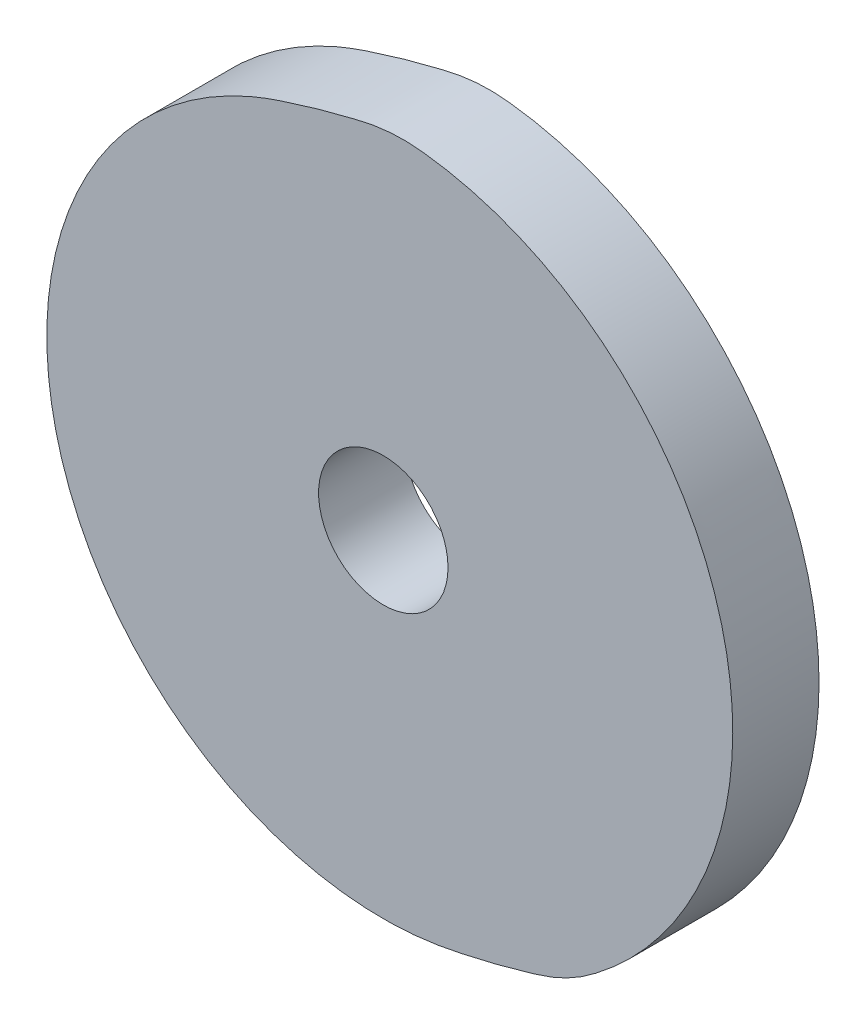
ISO-10303-21;
HEADER;
FILE_DESCRIPTION(('STEP AP214'),'2;1');
FILE_NAME('part.step','',(''),(''),'','','');
FILE_SCHEMA(('AUTOMOTIVE_DESIGN { 1 0 10303 214 1 1 1 1 }'));
ENDSEC;
DATA;
#1=APPLICATION_CONTEXT('core data for automotive mechanical design processes');
#2=APPLICATION_PROTOCOL_DEFINITION('international standard','automotive_design',2000,#1);
#3=PRODUCT_CONTEXT('',#1,'mechanical');
#4=PRODUCT('Part','Part','',(#3));
#5=PRODUCT_RELATED_PRODUCT_CATEGORY('part','',(#4));
#6=PRODUCT_DEFINITION_FORMATION('','',#4);
#7=PRODUCT_DEFINITION_CONTEXT('part definition',#1,'design');
#8=PRODUCT_DEFINITION('design','',#6,#7);
#9=PRODUCT_DEFINITION_SHAPE('','',#8);
#10=(LENGTH_UNIT() NAMED_UNIT(*) SI_UNIT(.MILLI.,.METRE.));
#11=(NAMED_UNIT(*) PLANE_ANGLE_UNIT() SI_UNIT($,.RADIAN.));
#12=(NAMED_UNIT(*) SI_UNIT($,.STERADIAN.) SOLID_ANGLE_UNIT());
#13=UNCERTAINTY_MEASURE_WITH_UNIT(LENGTH_MEASURE(1.E-05),#10,'distance_accuracy_value','');
#14=(GEOMETRIC_REPRESENTATION_CONTEXT(3) GLOBAL_UNCERTAINTY_ASSIGNED_CONTEXT((#13)) GLOBAL_UNIT_ASSIGNED_CONTEXT((#10,
#11,#12)) REPRESENTATION_CONTEXT('',''));
#15=CARTESIAN_POINT('',(0.,0.,0.));
#16=DIRECTION('',(0.,0.,1.));
#17=DIRECTION('',(1.,0.,0.));
#18=AXIS2_PLACEMENT_3D('',#15,#16,#17);
#19=CARTESIAN_POINT('',(24.1531222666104,-32.5100117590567,5.));
#20=DIRECTION('',(0.,0.,-1.));
#21=DIRECTION('',(-1.,0.,0.));
#22=AXIS2_PLACEMENT_3D('',#19,#20,#21);
#23=PLANE('',#22);
#24=CARTESIAN_POINT('',(-15.3387228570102,35.8569878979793,5.));
#25=CARTESIAN_POINT('',(-70.6305611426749,12.2045219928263,5.));
#26=CARTESIAN_POINT('',(-55.0655992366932,-45.884706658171,5.));
#27=CARTESIAN_POINT('',(4.64477029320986,-38.7224238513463,5.));
#28=CARTESIAN_POINT('',(5.25984959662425,-38.648644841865,5.));
#29=CARTESIAN_POINT('',(6.48649241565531,-38.4717764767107,5.));
#30=CARTESIAN_POINT('',(8.31338347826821,-38.1159843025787,5.));
#31=CARTESIAN_POINT('',(9.52519309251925,-37.8576945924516,5.));
#32=CARTESIAN_POINT('',(10.1298456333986,-37.722931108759,5.));
#33=CARTESIAN_POINT('',(11.9234665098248,-37.32317326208,5.));
#34=CARTESIAN_POINT('',(13.7053898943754,-36.8741395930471,5.));
#35=CARTESIAN_POINT('',(15.474262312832,-36.3761711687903,5.));
#36=CARTESIAN_POINT('',(15.9471654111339,-36.2430407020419,5.));
#37=CARTESIAN_POINT('',(16.8910094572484,-35.9698098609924,5.));
#38=CARTESIAN_POINT('',(18.3069001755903,-35.5515756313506,5.));
#39=CARTESIAN_POINT('',(19.2310213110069,-35.2157853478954,5.));
#40=CARTESIAN_POINT('',(19.6862774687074,-35.031115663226,5.));
#41=CARTESIAN_POINT('',(20.7177003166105,-34.612730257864,5.));
#42=CARTESIAN_POINT('',(21.7106943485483,-34.1098959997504,5.));
#43=CARTESIAN_POINT('',(22.6583597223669,-33.5261068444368,5.));
#44=CARTESIAN_POINT('',(22.9760025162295,-33.330429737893,5.));
#45=CARTESIAN_POINT('',(23.6003377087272,-32.9212997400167,5.));
#46=CARTESIAN_POINT('',(24.5020116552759,-32.253977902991,5.));
#47=CARTESIAN_POINT('',(25.0899315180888,-31.7944102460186,5.));
#48=CARTESIAN_POINT('',(25.3806608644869,-31.5606092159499,5.));
#49=CARTESIAN_POINT('',(57.3352516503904,-5.86311312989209,5.));
#50=CARTESIAN_POINT('',(46.7222278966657,33.7452307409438,5.));
#51=CARTESIAN_POINT('',(6.19999246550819,40.0226197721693,5.));
#52=CARTESIAN_POINT('',(5.83131295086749,40.0797327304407,5.));
#53=CARTESIAN_POINT('',(5.09237558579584,40.1837700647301,5.));
#54=CARTESIAN_POINT('',(3.97784212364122,40.3108507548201,5.));
#55=CARTESIAN_POINT('',(3.23258698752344,40.3530001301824,5.));
#56=CARTESIAN_POINT('',(2.85966170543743,40.363640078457,5.));
#57=CARTESIAN_POINT('',(1.74706483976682,40.3953836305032,5.));
#58=CARTESIAN_POINT('',(0.635689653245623,40.3343538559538,5.));
#59=CARTESIAN_POINT('',(-0.466741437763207,40.1809748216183,5.));
#60=CARTESIAN_POINT('',(-0.953339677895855,40.1132753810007,5.));
#61=CARTESIAN_POINT('',(-1.92154719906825,39.9420177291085,5.));
#62=CARTESIAN_POINT('',(-3.35686164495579,39.5962738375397,5.));
#63=CARTESIAN_POINT('',(-4.31086998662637,39.3609766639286,5.));
#64=CARTESIAN_POINT('',(-4.78698131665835,39.2398194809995,5.));
#65=CARTESIAN_POINT('',(-6.56785397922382,38.7866365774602,5.));
#66=CARTESIAN_POINT('',(-8.33556173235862,38.2845494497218,5.));
#67=CARTESIAN_POINT('',(-10.0887618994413,37.7339394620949,5.));
#68=CARTESIAN_POINT('',(-10.679788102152,37.5483217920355,5.));
#69=CARTESIAN_POINT('',(-11.8583908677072,37.1661024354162,5.));
#70=CARTESIAN_POINT('',(-13.6184210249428,36.5607819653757,5.));
#71=CARTESIAN_POINT('',(-14.7691590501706,36.1006330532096,5.));
#72=CARTESIAN_POINT('',(-15.3387228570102,35.8569878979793,5.));
#73=(BOUNDED_CURVE() B_SPLINE_CURVE(3,(#24,#25,#26,#27,#28,#29,#30,#31,#32,#33,#34,#35,#36,#37,
#38,#39,#40,#41,#42,#43,#44,#45,#46,#47,#48,#49,#50,#51,#52,#53,#54,#55,#56,#57,#58,#59,#60,#61,
#62,#63,#64,#65,#66,#67,#68,#69,#70,#71,#72),.UNSPECIFIED.,.T.,
.F.) B_SPLINE_CURVE_WITH_KNOTS((4,3,1,1,3,3,1,1,3,3,1,1,3,3,1,1,3,3,1,1,3,3,1,1,4),(0.,
0.394506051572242,0.404001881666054,0.413497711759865,0.422993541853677,0.451154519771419,
0.458685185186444,0.466215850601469,0.473746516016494,0.490768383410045,0.496487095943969,
0.502205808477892,0.507924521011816,0.886581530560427,0.89230024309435,0.898018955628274,
0.903737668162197,0.920759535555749,0.928290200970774,0.935820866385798,0.943351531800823,
0.971512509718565,0.981008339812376,0.990504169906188,1.),
.UNSPECIFIED.) CURVE() GEOMETRIC_REPRESENTATION_ITEM() RATIONAL_B_SPLINE_CURVE((1.,
0.427958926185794,0.427958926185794,1.,1.,1.,1.,1.,1.,0.999746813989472,0.999746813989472,1.,1.,
1.,1.,1.,1.,0.997683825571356,0.997683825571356,1.,1.,1.,1.,1.,1.,0.602425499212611,
0.602425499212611,1.,1.,1.,1.,1.,1.,0.997683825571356,0.997683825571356,1.,1.,1.,1.,1.,1.,
0.999746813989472,0.999746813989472,1.,1.,1.,1.,1.,1.)) REPRESENTATION_ITEM(''));
#74=CARTESIAN_POINT('',(-15.3387228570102,35.8569878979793,5.));
#75=VERTEX_POINT('',#74);
#76=EDGE_CURVE('E10',#75,#75,#73,.T.);
#77=ORIENTED_EDGE('',*,*,#76,.T.);
#78=EDGE_LOOP('',(#77));
#79=FACE_BOUND('',#78,.T.);
#80=CARTESIAN_POINT('',(0.,0.,5.));
#81=DIRECTION('',(0.,0.,1.));
#82=DIRECTION('',(1.,0.,0.));
#83=AXIS2_PLACEMENT_3D('',#80,#81,#82);
#84=CIRCLE('',#83,7.5);
#85=CARTESIAN_POINT('',(7.5,0.,5.));
#86=VERTEX_POINT('',#85);
#87=EDGE_CURVE('E44',#86,#86,#84,.T.);
#88=ORIENTED_EDGE('',*,*,#87,.F.);
#89=EDGE_LOOP('',(#88));
#90=FACE_BOUND('',#89,.T.);
#91=ADVANCED_FACE('F31',(#79,#90),#23,.F.);
#92=CARTESIAN_POINT('',(24.1531222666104,-32.5100117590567,-5.));
#93=DIRECTION('',(0.,0.,-1.));
#94=DIRECTION('',(-1.,0.,0.));
#95=AXIS2_PLACEMENT_3D('',#92,#93,#94);
#96=PLANE('',#95);
#97=CARTESIAN_POINT('',(-15.3387228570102,35.8569878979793,-5.));
#98=CARTESIAN_POINT('',(-70.6305611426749,12.2045219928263,-5.));
#99=CARTESIAN_POINT('',(-55.0655992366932,-45.884706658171,-5.));
#100=CARTESIAN_POINT('',(4.64477029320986,-38.7224238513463,-5.));
#101=CARTESIAN_POINT('',(5.25984959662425,-38.648644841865,-5.));
#102=CARTESIAN_POINT('',(6.48649241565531,-38.4717764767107,-5.));
#103=CARTESIAN_POINT('',(8.31338347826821,-38.1159843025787,-5.));
#104=CARTESIAN_POINT('',(9.52519309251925,-37.8576945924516,-5.));
#105=CARTESIAN_POINT('',(10.1298456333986,-37.722931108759,-5.));
#106=CARTESIAN_POINT('',(11.9234665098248,-37.32317326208,-5.));
#107=CARTESIAN_POINT('',(13.7053898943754,-36.8741395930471,-5.));
#108=CARTESIAN_POINT('',(15.474262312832,-36.3761711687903,-5.));
#109=CARTESIAN_POINT('',(15.9471654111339,-36.2430407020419,-5.));
#110=CARTESIAN_POINT('',(16.8910094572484,-35.9698098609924,-5.));
#111=CARTESIAN_POINT('',(18.3069001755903,-35.5515756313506,-5.));
#112=CARTESIAN_POINT('',(19.2310213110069,-35.2157853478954,-5.));
#113=CARTESIAN_POINT('',(19.6862774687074,-35.031115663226,-5.));
#114=CARTESIAN_POINT('',(20.7177003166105,-34.612730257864,-5.));
#115=CARTESIAN_POINT('',(21.7106943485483,-34.1098959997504,-5.));
#116=CARTESIAN_POINT('',(22.6583597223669,-33.5261068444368,-5.));
#117=CARTESIAN_POINT('',(22.9760025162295,-33.330429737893,-5.));
#118=CARTESIAN_POINT('',(23.6003377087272,-32.9212997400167,-5.));
#119=CARTESIAN_POINT('',(24.5020116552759,-32.253977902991,-5.));
#120=CARTESIAN_POINT('',(25.0899315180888,-31.7944102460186,-5.));
#121=CARTESIAN_POINT('',(25.3806608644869,-31.5606092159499,-5.));
#122=CARTESIAN_POINT('',(57.3352516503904,-5.86311312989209,-5.));
#123=CARTESIAN_POINT('',(46.7222278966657,33.7452307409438,-5.));
#124=CARTESIAN_POINT('',(6.19999246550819,40.0226197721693,-5.));
#125=CARTESIAN_POINT('',(5.83131295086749,40.0797327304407,-5.));
#126=CARTESIAN_POINT('',(5.09237558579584,40.1837700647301,-5.));
#127=CARTESIAN_POINT('',(3.97784212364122,40.3108507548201,-5.));
#128=CARTESIAN_POINT('',(3.23258698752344,40.3530001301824,-5.));
#129=CARTESIAN_POINT('',(2.85966170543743,40.363640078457,-5.));
#130=CARTESIAN_POINT('',(1.74706483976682,40.3953836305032,-5.));
#131=CARTESIAN_POINT('',(0.635689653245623,40.3343538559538,-5.));
#132=CARTESIAN_POINT('',(-0.466741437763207,40.1809748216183,-5.));
#133=CARTESIAN_POINT('',(-0.953339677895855,40.1132753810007,-5.));
#134=CARTESIAN_POINT('',(-1.92154719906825,39.9420177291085,-5.));
#135=CARTESIAN_POINT('',(-3.35686164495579,39.5962738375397,-5.));
#136=CARTESIAN_POINT('',(-4.31086998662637,39.3609766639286,-5.));
#137=CARTESIAN_POINT('',(-4.78698131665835,39.2398194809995,-5.));
#138=CARTESIAN_POINT('',(-6.56785397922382,38.7866365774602,-5.));
#139=CARTESIAN_POINT('',(-8.33556173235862,38.2845494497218,-5.));
#140=CARTESIAN_POINT('',(-10.0887618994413,37.7339394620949,-5.));
#141=CARTESIAN_POINT('',(-10.679788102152,37.5483217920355,-5.));
#142=CARTESIAN_POINT('',(-11.8583908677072,37.1661024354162,-5.));
#143=CARTESIAN_POINT('',(-13.6184210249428,36.5607819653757,-5.));
#144=CARTESIAN_POINT('',(-14.7691590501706,36.1006330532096,-5.));
#145=CARTESIAN_POINT('',(-15.3387228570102,35.8569878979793,-5.));
#146=(BOUNDED_CURVE() B_SPLINE_CURVE(3,(#97,#98,#99,#100,#101,#102,#103,#104,#105,#106,#107,
#108,#109,#110,#111,#112,#113,#114,#115,#116,#117,#118,#119,#120,#121,#122,#123,#124,#125,#126,
#127,#128,#129,#130,#131,#132,#133,#134,#135,#136,#137,#138,#139,#140,#141,#142,#143,#144,#145),
.UNSPECIFIED.,.T.,.F.) B_SPLINE_CURVE_WITH_KNOTS((4,3,1,1,3,3,1,1,3,3,1,1,3,3,1,1,3,3,1,1,3,3,1,
1,4),(0.,0.394506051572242,0.404001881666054,0.413497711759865,0.422993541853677,
0.451154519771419,0.458685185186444,0.466215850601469,0.473746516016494,0.490768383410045,
0.496487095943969,0.502205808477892,0.507924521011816,0.886581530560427,0.89230024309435,
0.898018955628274,0.903737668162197,0.920759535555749,0.928290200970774,0.935820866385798,
0.943351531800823,0.971512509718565,0.981008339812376,0.990504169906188,1.),
.UNSPECIFIED.) CURVE() GEOMETRIC_REPRESENTATION_ITEM() RATIONAL_B_SPLINE_CURVE((1.,
0.427958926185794,0.427958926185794,1.,1.,1.,1.,1.,1.,0.999746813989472,0.999746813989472,1.,1.,
1.,1.,1.,1.,0.997683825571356,0.997683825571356,1.,1.,1.,1.,1.,1.,0.602425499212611,
0.602425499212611,1.,1.,1.,1.,1.,1.,0.997683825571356,0.997683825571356,1.,1.,1.,1.,1.,1.,
0.999746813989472,0.999746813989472,1.,1.,1.,1.,1.,1.)) REPRESENTATION_ITEM(''));
#147=CARTESIAN_POINT('',(-15.3387228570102,35.8569878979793,-5.));
#148=VERTEX_POINT('',#147);
#149=EDGE_CURVE('E36',#148,#148,#146,.T.);
#150=ORIENTED_EDGE('',*,*,#149,.F.);
#151=EDGE_LOOP('',(#150));
#152=FACE_BOUND('',#151,.T.);
#153=CARTESIAN_POINT('',(0.,0.,-5.));
#154=DIRECTION('',(0.,0.,1.));
#155=DIRECTION('',(1.,0.,0.));
#156=AXIS2_PLACEMENT_3D('',#153,#154,#155);
#157=CIRCLE('',#156,7.5);
#158=CARTESIAN_POINT('',(7.5,0.,-5.));
#159=VERTEX_POINT('',#158);
#160=EDGE_CURVE('E49',#159,#159,#157,.T.);
#161=ORIENTED_EDGE('',*,*,#160,.T.);
#162=EDGE_LOOP('',(#161));
#163=FACE_BOUND('',#162,.T.);
#164=ADVANCED_FACE('F62',(#152,#163),#96,.T.);
#165=DIRECTION('',(0.,0.,-1.));
#166=VECTOR('',#165,1.);
#167=SURFACE_OF_LINEAR_EXTRUSION('',#73,#166);
#168=ORIENTED_EDGE('',*,*,#76,.F.);
#169=EDGE_LOOP('',(#168));
#170=FACE_BOUND('',#169,.T.);
#171=ORIENTED_EDGE('',*,*,#149,.T.);
#172=EDGE_LOOP('',(#171));
#173=FACE_BOUND('',#172,.T.);
#174=ADVANCED_FACE('F33',(#170,#173),#167,.F.);
#175=CARTESIAN_POINT('',(0.,0.,5.));
#176=DIRECTION('',(0.,0.,-1.));
#177=DIRECTION('',(-1.,0.,0.));
#178=AXIS2_PLACEMENT_3D('',#175,#176,#177);
#179=CYLINDRICAL_SURFACE('',#178,7.5);
#180=ORIENTED_EDGE('',*,*,#87,.T.);
#181=EDGE_LOOP('',(#180));
#182=FACE_BOUND('',#181,.T.);
#183=ORIENTED_EDGE('',*,*,#160,.F.);
#184=EDGE_LOOP('',(#183));
#185=FACE_BOUND('',#184,.T.);
#186=ADVANCED_FACE('F58',(#182,#185),#179,.F.);
#187=CLOSED_SHELL('',(#91,#164,#174,#186));
#188=MANIFOLD_SOLID_BREP('B2',#187);
#189=ADVANCED_BREP_SHAPE_REPRESENTATION('',(#18,#188),#14);
#190=SHAPE_DEFINITION_REPRESENTATION(#9,#189);
ENDSEC;
END-ISO-10303-21;
